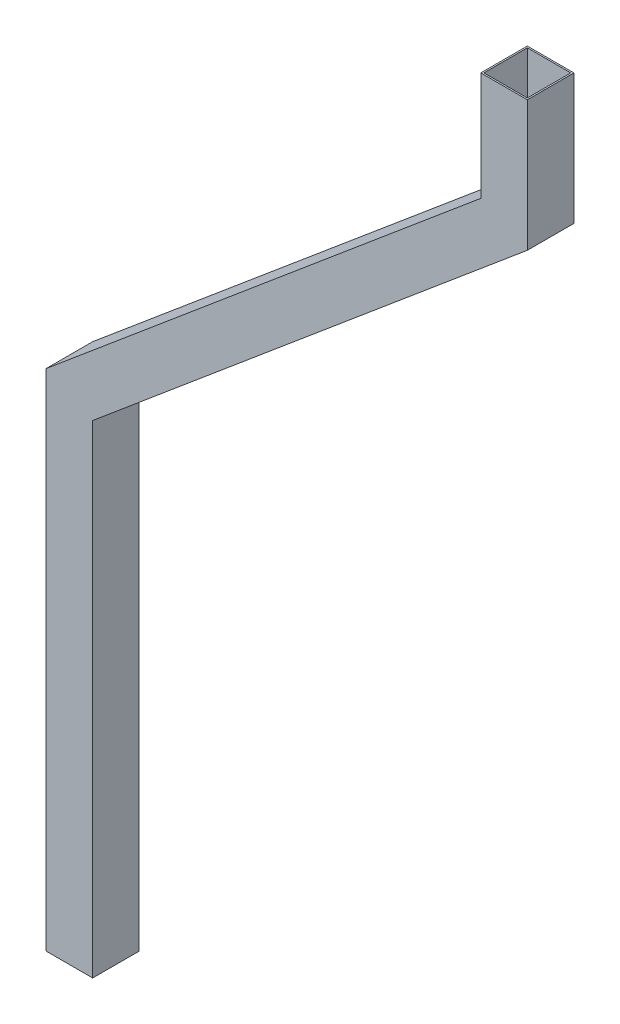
ISO-10303-21;
HEADER;
FILE_DESCRIPTION(('STEP AP214'),'2;1');
FILE_NAME('part.step','',(''),(''),'','','');
FILE_SCHEMA(('AUTOMOTIVE_DESIGN { 1 0 10303 214 1 1 1 1 }'));
ENDSEC;
DATA;
#1=APPLICATION_CONTEXT('core data for automotive mechanical design processes');
#2=APPLICATION_PROTOCOL_DEFINITION('international standard','automotive_design',2000,#1);
#3=PRODUCT_CONTEXT('',#1,'mechanical');
#4=PRODUCT('Part','Part','',(#3));
#5=PRODUCT_RELATED_PRODUCT_CATEGORY('part','',(#4));
#6=PRODUCT_DEFINITION_FORMATION('','',#4);
#7=PRODUCT_DEFINITION_CONTEXT('part definition',#1,'design');
#8=PRODUCT_DEFINITION('design','',#6,#7);
#9=PRODUCT_DEFINITION_SHAPE('','',#8);
#10=(LENGTH_UNIT() NAMED_UNIT(*) SI_UNIT(.MILLI.,.METRE.));
#11=(NAMED_UNIT(*) PLANE_ANGLE_UNIT() SI_UNIT($,.RADIAN.));
#12=(NAMED_UNIT(*) SI_UNIT($,.STERADIAN.) SOLID_ANGLE_UNIT());
#13=UNCERTAINTY_MEASURE_WITH_UNIT(LENGTH_MEASURE(1.E-05),#10,'distance_accuracy_value','');
#14=(GEOMETRIC_REPRESENTATION_CONTEXT(3) GLOBAL_UNCERTAINTY_ASSIGNED_CONTEXT((#13)) GLOBAL_UNIT_ASSIGNED_CONTEXT((#10,
#11,#12)) REPRESENTATION_CONTEXT('',''));
#15=CARTESIAN_POINT('',(0.,0.,0.));
#16=DIRECTION('',(0.,0.,1.));
#17=DIRECTION('',(1.,0.,0.));
#18=AXIS2_PLACEMENT_3D('',#15,#16,#17);
#19=CARTESIAN_POINT('',(280.,629.947896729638,0.));
#20=DIRECTION('',(0.,1.,0.));
#21=DIRECTION('',(0.,0.,1.));
#22=AXIS2_PLACEMENT_3D('',#19,#20,#21);
#23=PLANE('',#22);
#24=DIRECTION('',(0.,0.,1.));
#25=VECTOR('',#24,1.);
#26=CARTESIAN_POINT('',(281.,629.947896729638,0.));
#27=LINE('',#26,#25);
#28=CARTESIAN_POINT('',(281.,629.947896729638,1.));
#29=VERTEX_POINT('',#28);
#30=CARTESIAN_POINT('',(281.,629.947896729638,29.));
#31=VERTEX_POINT('',#30);
#32=EDGE_CURVE('E166',#29,#31,#27,.T.);
#33=ORIENTED_EDGE('',*,*,#32,.F.);
#34=DIRECTION('',(-1.,0.,0.));
#35=VECTOR('',#34,1.);
#36=CARTESIAN_POINT('',(280.,629.947896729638,1.));
#37=LINE('',#36,#35);
#38=CARTESIAN_POINT('',(309.,629.947896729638,1.));
#39=VERTEX_POINT('',#38);
#40=EDGE_CURVE('E199',#39,#29,#37,.T.);
#41=ORIENTED_EDGE('',*,*,#40,.F.);
#42=DIRECTION('',(0.,0.,-1.));
#43=VECTOR('',#42,1.);
#44=CARTESIAN_POINT('',(309.,629.947896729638,0.));
#45=LINE('',#44,#43);
#46=CARTESIAN_POINT('',(309.,629.947896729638,29.));
#47=VERTEX_POINT('',#46);
#48=EDGE_CURVE('E197',#47,#39,#45,.T.);
#49=ORIENTED_EDGE('',*,*,#48,.F.);
#50=DIRECTION('',(1.,0.,0.));
#51=VECTOR('',#50,1.);
#52=CARTESIAN_POINT('',(280.,629.947896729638,29.));
#53=LINE('',#52,#51);
#54=EDGE_CURVE('E195',#31,#47,#53,.T.);
#55=ORIENTED_EDGE('',*,*,#54,.F.);
#56=EDGE_LOOP('',(#33,#41,#49,#55));
#57=FACE_BOUND('',#56,.T.);
#58=DIRECTION('',(0.,0.,1.));
#59=VECTOR('',#58,1.);
#60=CARTESIAN_POINT('',(280.,629.947896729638,0.));
#61=LINE('',#60,#59);
#62=CARTESIAN_POINT('',(280.,629.947896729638,0.));
#63=VERTEX_POINT('',#62);
#64=CARTESIAN_POINT('',(280.,629.947896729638,30.));
#65=VERTEX_POINT('',#64);
#66=EDGE_CURVE('E261',#63,#65,#61,.T.);
#67=ORIENTED_EDGE('',*,*,#66,.T.);
#68=DIRECTION('',(1.,0.,0.));
#69=VECTOR('',#68,1.);
#70=CARTESIAN_POINT('',(280.,629.947896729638,30.));
#71=LINE('',#70,#69);
#72=CARTESIAN_POINT('',(310.,629.947896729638,30.));
#73=VERTEX_POINT('',#72);
#74=EDGE_CURVE('E259',#65,#73,#71,.T.);
#75=ORIENTED_EDGE('',*,*,#74,.T.);
#76=DIRECTION('',(0.,0.,-1.));
#77=VECTOR('',#76,1.);
#78=CARTESIAN_POINT('',(310.,629.947896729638,0.));
#79=LINE('',#78,#77);
#80=CARTESIAN_POINT('',(310.,629.947896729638,0.));
#81=VERTEX_POINT('',#80);
#82=EDGE_CURVE('E257',#73,#81,#79,.T.);
#83=ORIENTED_EDGE('',*,*,#82,.T.);
#84=DIRECTION('',(-1.,0.,0.));
#85=VECTOR('',#84,1.);
#86=CARTESIAN_POINT('',(280.,629.947896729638,0.));
#87=LINE('',#86,#85);
#88=EDGE_CURVE('E204',#81,#63,#87,.T.);
#89=ORIENTED_EDGE('',*,*,#88,.T.);
#90=EDGE_LOOP('',(#67,#75,#83,#89));
#91=FACE_BOUND('',#90,.T.);
#92=ADVANCED_FACE('F34',(#57,#91),#23,.T.);
#93=CARTESIAN_POINT('',(0.,0.,0.));
#94=DIRECTION('',(0.,1.,0.));
#95=DIRECTION('',(0.,0.,1.));
#96=AXIS2_PLACEMENT_3D('',#93,#94,#95);
#97=PLANE('',#96);
#98=DIRECTION('',(-1.,0.,0.));
#99=VECTOR('',#98,1.);
#100=CARTESIAN_POINT('',(0.,0.,1.));
#101=LINE('',#100,#99);
#102=CARTESIAN_POINT('',(29.,0.,1.));
#103=VERTEX_POINT('',#102);
#104=CARTESIAN_POINT('',(0.999999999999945,0.,1.));
#105=VERTEX_POINT('',#104);
#106=EDGE_CURVE('E189',#103,#105,#101,.T.);
#107=ORIENTED_EDGE('',*,*,#106,.T.);
#108=DIRECTION('',(0.,0.,1.));
#109=VECTOR('',#108,1.);
#110=CARTESIAN_POINT('',(1.,0.,0.));
#111=LINE('',#110,#109);
#112=CARTESIAN_POINT('',(1.,0.,29.));
#113=VERTEX_POINT('',#112);
#114=EDGE_CURVE('E201',#105,#113,#111,.T.);
#115=ORIENTED_EDGE('',*,*,#114,.T.);
#116=DIRECTION('',(1.,0.,0.));
#117=VECTOR('',#116,1.);
#118=CARTESIAN_POINT('',(0.,0.,29.));
#119=LINE('',#118,#117);
#120=CARTESIAN_POINT('',(29.,0.,29.));
#121=VERTEX_POINT('',#120);
#122=EDGE_CURVE('E205',#113,#121,#119,.T.);
#123=ORIENTED_EDGE('',*,*,#122,.T.);
#124=DIRECTION('',(0.,0.,-1.));
#125=VECTOR('',#124,1.);
#126=CARTESIAN_POINT('',(29.,0.,0.));
#127=LINE('',#126,#125);
#128=EDGE_CURVE('E208',#121,#103,#127,.T.);
#129=ORIENTED_EDGE('',*,*,#128,.T.);
#130=EDGE_LOOP('',(#107,#115,#123,#129));
#131=FACE_BOUND('',#130,.T.);
#132=DIRECTION('',(0.,0.,1.));
#133=VECTOR('',#132,1.);
#134=CARTESIAN_POINT('',(0.,0.,0.));
#135=LINE('',#134,#133);
#136=CARTESIAN_POINT('',(0.,0.,0.));
#137=VERTEX_POINT('',#136);
#138=CARTESIAN_POINT('',(0.,0.,30.));
#139=VERTEX_POINT('',#138);
#140=EDGE_CURVE('E11',#137,#139,#135,.T.);
#141=ORIENTED_EDGE('',*,*,#140,.F.);
#142=DIRECTION('',(-1.,0.,0.));
#143=VECTOR('',#142,1.);
#144=CARTESIAN_POINT('',(0.,0.,0.));
#145=LINE('',#144,#143);
#146=CARTESIAN_POINT('',(30.,0.,0.));
#147=VERTEX_POINT('',#146);
#148=EDGE_CURVE('E213',#147,#137,#145,.T.);
#149=ORIENTED_EDGE('',*,*,#148,.F.);
#150=DIRECTION('',(0.,0.,-1.));
#151=VECTOR('',#150,1.);
#152=CARTESIAN_POINT('',(30.,0.,0.));
#153=LINE('',#152,#151);
#154=CARTESIAN_POINT('',(30.,0.,30.));
#155=VERTEX_POINT('',#154);
#156=EDGE_CURVE('E216',#155,#147,#153,.T.);
#157=ORIENTED_EDGE('',*,*,#156,.F.);
#158=DIRECTION('',(1.,0.,0.));
#159=VECTOR('',#158,1.);
#160=CARTESIAN_POINT('',(0.,0.,30.));
#161=LINE('',#160,#159);
#162=EDGE_CURVE('E42',#139,#155,#161,.T.);
#163=ORIENTED_EDGE('',*,*,#162,.F.);
#164=EDGE_LOOP('',(#141,#149,#157,#163));
#165=FACE_BOUND('',#164,.T.);
#166=ADVANCED_FACE('F291',(#131,#165),#97,.F.);
#167=CARTESIAN_POINT('',(280.,544.459744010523,0.));
#168=DIRECTION('',(-1.,0.,0.));
#169=DIRECTION('',(0.,-1.,0.));
#170=AXIS2_PLACEMENT_3D('',#167,#168,#169);
#171=PLANE('',#170);
#172=DIRECTION('',(0.,0.,-1.));
#173=VECTOR('',#172,1.);
#174=CARTESIAN_POINT('',(280.,559.947896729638,0.));
#175=LINE('',#174,#173);
#176=CARTESIAN_POINT('',(280.,559.947896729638,30.));
#177=VERTEX_POINT('',#176);
#178=CARTESIAN_POINT('',(280.,559.947896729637,0.));
#179=VERTEX_POINT('',#178);
#180=EDGE_CURVE('E241',#177,#179,#175,.T.);
#181=ORIENTED_EDGE('',*,*,#180,.F.);
#182=DIRECTION('',(0.,1.,0.));
#183=VECTOR('',#182,1.);
#184=CARTESIAN_POINT('',(280.,544.459744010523,30.));
#185=LINE('',#184,#183);
#186=EDGE_CURVE('E268',#177,#65,#185,.T.);
#187=ORIENTED_EDGE('',*,*,#186,.T.);
#188=ORIENTED_EDGE('',*,*,#66,.F.);
#189=DIRECTION('',(0.,1.,0.));
#190=VECTOR('',#189,1.);
#191=CARTESIAN_POINT('',(280.,544.459744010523,0.));
#192=LINE('',#191,#190);
#193=EDGE_CURVE('E37',#179,#63,#192,.T.);
#194=ORIENTED_EDGE('',*,*,#193,.F.);
#195=EDGE_LOOP('',(#181,#187,#188,#194));
#196=FACE_BOUND('',#195,.T.);
#197=ADVANCED_FACE('F278',(#196),#171,.T.);
#198=CARTESIAN_POINT('',(310.,544.459744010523,0.));
#199=DIRECTION('',(1.,0.,0.));
#200=DIRECTION('',(0.,1.,0.));
#201=AXIS2_PLACEMENT_3D('',#198,#199,#200);
#202=PLANE('',#201);
#203=DIRECTION('',(0.,0.,1.));
#204=VECTOR('',#203,1.);
#205=CARTESIAN_POINT('',(310.,545.958666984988,-1.11022302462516E-13));
#206=LINE('',#205,#204);
#207=CARTESIAN_POINT('',(310.,545.958666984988,0.));
#208=VERTEX_POINT('',#207);
#209=CARTESIAN_POINT('',(310.,545.958666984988,30.));
#210=VERTEX_POINT('',#209);
#211=EDGE_CURVE('E234',#208,#210,#206,.T.);
#212=ORIENTED_EDGE('',*,*,#211,.F.);
#213=DIRECTION('',(0.,1.,0.));
#214=VECTOR('',#213,1.);
#215=CARTESIAN_POINT('',(310.,544.459744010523,0.));
#216=LINE('',#215,#214);
#217=EDGE_CURVE('E263',#208,#81,#216,.T.);
#218=ORIENTED_EDGE('',*,*,#217,.T.);
#219=ORIENTED_EDGE('',*,*,#82,.F.);
#220=DIRECTION('',(0.,1.,0.));
#221=VECTOR('',#220,1.);
#222=CARTESIAN_POINT('',(310.,544.459744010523,30.));
#223=LINE('',#222,#221);
#224=EDGE_CURVE('E266',#210,#73,#223,.T.);
#225=ORIENTED_EDGE('',*,*,#224,.F.);
#226=EDGE_LOOP('',(#212,#218,#219,#225));
#227=FACE_BOUND('',#226,.T.);
#228=ADVANCED_FACE('F300',(#227),#202,.T.);
#229=CARTESIAN_POINT('',(19.2836282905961,302.018666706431,0.));
#230=DIRECTION('',(0.642787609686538,-0.766044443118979,0.));
#231=DIRECTION('',(0.766044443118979,0.642787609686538,0.));
#232=AXIS2_PLACEMENT_3D('',#229,#230,#231);
#233=PLANE('',#232);
#234=DIRECTION('',(0.766044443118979,0.642787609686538,0.));
#235=VECTOR('',#234,1.);
#236=CARTESIAN_POINT('',(19.2836282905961,302.018666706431,0.));
#237=LINE('',#236,#235);
#238=CARTESIAN_POINT('',(30.,311.01077025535,0.));
#239=VERTEX_POINT('',#238);
#240=EDGE_CURVE('E249',#239,#208,#237,.T.);
#241=ORIENTED_EDGE('',*,*,#240,.T.);
#242=ORIENTED_EDGE('',*,*,#211,.T.);
#243=DIRECTION('',(0.766044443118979,0.642787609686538,0.));
#244=VECTOR('',#243,1.);
#245=CARTESIAN_POINT('',(19.2836282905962,302.018666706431,30.));
#246=LINE('',#245,#244);
#247=CARTESIAN_POINT('',(30.,311.01077025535,30.));
#248=VERTEX_POINT('',#247);
#249=EDGE_CURVE('E248',#248,#210,#246,.T.);
#250=ORIENTED_EDGE('',*,*,#249,.F.);
#251=DIRECTION('',(0.,0.,1.));
#252=VECTOR('',#251,1.);
#253=CARTESIAN_POINT('',(30.,311.01077025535,0.));
#254=LINE('',#253,#252);
#255=EDGE_CURVE('E230',#239,#248,#254,.T.);
#256=ORIENTED_EDGE('',*,*,#255,.F.);
#257=EDGE_LOOP('',(#241,#242,#250,#256));
#258=FACE_BOUND('',#257,.T.);
#259=ADVANCED_FACE('F298',(#258),#233,.T.);
#260=CARTESIAN_POINT('',(0.,325.,0.));
#261=DIRECTION('',(-0.642787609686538,0.766044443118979,0.));
#262=DIRECTION('',(-0.766044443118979,-0.642787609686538,0.));
#263=AXIS2_PLACEMENT_3D('',#260,#261,#262);
#264=PLANE('',#263);
#265=DIRECTION('',(0.766044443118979,0.642787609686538,0.));
#266=VECTOR('',#265,1.);
#267=CARTESIAN_POINT('',(0.,325.,30.));
#268=LINE('',#267,#266);
#269=CARTESIAN_POINT('',(0.,325.,30.));
#270=VERTEX_POINT('',#269);
#271=EDGE_CURVE('E245',#270,#177,#268,.T.);
#272=ORIENTED_EDGE('',*,*,#271,.T.);
#273=ORIENTED_EDGE('',*,*,#180,.T.);
#274=DIRECTION('',(0.766044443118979,0.642787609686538,0.));
#275=VECTOR('',#274,1.);
#276=CARTESIAN_POINT('',(0.,325.,0.));
#277=LINE('',#276,#275);
#278=CARTESIAN_POINT('',(0.,325.,0.));
#279=VERTEX_POINT('',#278);
#280=EDGE_CURVE('E242',#279,#179,#277,.T.);
#281=ORIENTED_EDGE('',*,*,#280,.F.);
#282=DIRECTION('',(0.,0.,1.));
#283=VECTOR('',#282,1.);
#284=CARTESIAN_POINT('',(0.,325.,0.));
#285=LINE('',#284,#283);
#286=EDGE_CURVE('E224',#279,#270,#285,.T.);
#287=ORIENTED_EDGE('',*,*,#286,.T.);
#288=EDGE_LOOP('',(#272,#273,#281,#287));
#289=FACE_BOUND('',#288,.T.);
#290=ADVANCED_FACE('F280',(#289),#264,.T.);
#291=CARTESIAN_POINT('',(0.,0.,0.));
#292=DIRECTION('',(-1.,0.,0.));
#293=DIRECTION('',(0.,0.,1.));
#294=AXIS2_PLACEMENT_3D('',#291,#292,#293);
#295=PLANE('',#294);
#296=DIRECTION('',(0.,1.,0.));
#297=VECTOR('',#296,1.);
#298=CARTESIAN_POINT('',(0.,0.,30.));
#299=LINE('',#298,#297);
#300=EDGE_CURVE('E225',#139,#270,#299,.T.);
#301=ORIENTED_EDGE('',*,*,#300,.T.);
#302=ORIENTED_EDGE('',*,*,#286,.F.);
#303=DIRECTION('',(0.,1.,0.));
#304=VECTOR('',#303,1.);
#305=CARTESIAN_POINT('',(0.,0.,0.));
#306=LINE('',#305,#304);
#307=EDGE_CURVE('E217',#137,#279,#306,.T.);
#308=ORIENTED_EDGE('',*,*,#307,.F.);
#309=ORIENTED_EDGE('',*,*,#140,.T.);
#310=EDGE_LOOP('',(#301,#302,#308,#309));
#311=FACE_BOUND('',#310,.T.);
#312=ADVANCED_FACE('F288',(#311),#295,.T.);
#313=CARTESIAN_POINT('',(0.,0.,30.));
#314=DIRECTION('',(0.,0.,1.));
#315=DIRECTION('',(1.,0.,0.));
#316=AXIS2_PLACEMENT_3D('',#313,#314,#315);
#317=PLANE('',#316);
#318=DIRECTION('',(0.,1.,0.));
#319=VECTOR('',#318,1.);
#320=CARTESIAN_POINT('',(30.,0.,30.));
#321=LINE('',#320,#319);
#322=EDGE_CURVE('E228',#155,#248,#321,.T.);
#323=ORIENTED_EDGE('',*,*,#322,.T.);
#324=ORIENTED_EDGE('',*,*,#249,.T.);
#325=ORIENTED_EDGE('',*,*,#224,.T.);
#326=ORIENTED_EDGE('',*,*,#74,.F.);
#327=ORIENTED_EDGE('',*,*,#186,.F.);
#328=ORIENTED_EDGE('',*,*,#271,.F.);
#329=ORIENTED_EDGE('',*,*,#300,.F.);
#330=ORIENTED_EDGE('',*,*,#162,.T.);
#331=EDGE_LOOP('',(#323,#324,#325,#326,#327,#328,#329,#330));
#332=FACE_BOUND('',#331,.T.);
#333=ADVANCED_FACE('F285',(#332),#317,.T.);
#334=CARTESIAN_POINT('',(30.,0.,0.));
#335=DIRECTION('',(1.,0.,0.));
#336=DIRECTION('',(0.,0.,-1.));
#337=AXIS2_PLACEMENT_3D('',#334,#335,#336);
#338=PLANE('',#337);
#339=DIRECTION('',(0.,1.,0.));
#340=VECTOR('',#339,1.);
#341=CARTESIAN_POINT('',(30.,0.,0.));
#342=LINE('',#341,#340);
#343=EDGE_CURVE('E233',#147,#239,#342,.T.);
#344=ORIENTED_EDGE('',*,*,#343,.T.);
#345=ORIENTED_EDGE('',*,*,#255,.T.);
#346=ORIENTED_EDGE('',*,*,#322,.F.);
#347=ORIENTED_EDGE('',*,*,#156,.T.);
#348=EDGE_LOOP('',(#344,#345,#346,#347));
#349=FACE_BOUND('',#348,.T.);
#350=ADVANCED_FACE('F295',(#349),#338,.T.);
#351=CARTESIAN_POINT('',(0.,0.,0.));
#352=DIRECTION('',(0.,0.,-1.));
#353=DIRECTION('',(-1.,0.,0.));
#354=AXIS2_PLACEMENT_3D('',#351,#352,#353);
#355=PLANE('',#354);
#356=ORIENTED_EDGE('',*,*,#307,.T.);
#357=ORIENTED_EDGE('',*,*,#280,.T.);
#358=ORIENTED_EDGE('',*,*,#193,.T.);
#359=ORIENTED_EDGE('',*,*,#88,.F.);
#360=ORIENTED_EDGE('',*,*,#217,.F.);
#361=ORIENTED_EDGE('',*,*,#240,.F.);
#362=ORIENTED_EDGE('',*,*,#343,.F.);
#363=ORIENTED_EDGE('',*,*,#148,.T.);
#364=EDGE_LOOP('',(#356,#357,#358,#359,#360,#361,#362,#363));
#365=FACE_BOUND('',#364,.T.);
#366=ADVANCED_FACE('F276',(#365),#355,.T.);
#367=CARTESIAN_POINT('',(281.,544.459744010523,0.));
#368=DIRECTION('',(-1.,0.,0.));
#369=DIRECTION('',(0.,-1.,0.));
#370=AXIS2_PLACEMENT_3D('',#367,#368,#369);
#371=PLANE('',#370);
#372=DIRECTION('',(0.,0.,-1.));
#373=VECTOR('',#372,1.);
#374=CARTESIAN_POINT('',(281.,559.481589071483,0.));
#375=LINE('',#374,#373);
#376=CARTESIAN_POINT('',(281.,559.481589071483,29.));
#377=VERTEX_POINT('',#376);
#378=CARTESIAN_POINT('',(281.,559.481589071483,1.));
#379=VERTEX_POINT('',#378);
#380=EDGE_CURVE('E150',#377,#379,#375,.T.);
#381=ORIENTED_EDGE('',*,*,#380,.T.);
#382=DIRECTION('',(0.,1.,0.));
#383=VECTOR('',#382,1.);
#384=CARTESIAN_POINT('',(281.,544.459744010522,1.));
#385=LINE('',#384,#383);
#386=EDGE_CURVE('E168',#379,#29,#385,.T.);
#387=ORIENTED_EDGE('',*,*,#386,.T.);
#388=ORIENTED_EDGE('',*,*,#32,.T.);
#389=DIRECTION('',(0.,1.,0.));
#390=VECTOR('',#389,1.);
#391=CARTESIAN_POINT('',(281.,544.459744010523,29.));
#392=LINE('',#391,#390);
#393=EDGE_CURVE('E163',#377,#31,#392,.T.);
#394=ORIENTED_EDGE('',*,*,#393,.F.);
#395=EDGE_LOOP('',(#381,#387,#388,#394));
#396=FACE_BOUND('',#395,.T.);
#397=ADVANCED_FACE('F164',(#396),#371,.F.);
#398=CARTESIAN_POINT('',(280.,544.459744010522,29.));
#399=DIRECTION('',(0.,0.,1.));
#400=DIRECTION('',(1.,0.,0.));
#401=AXIS2_PLACEMENT_3D('',#398,#399,#400);
#402=PLANE('',#401);
#403=DIRECTION('',(0.,1.,0.));
#404=VECTOR('',#403,1.);
#405=CARTESIAN_POINT('',(309.,544.459744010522,29.));
#406=LINE('',#405,#404);
#407=CARTESIAN_POINT('',(309.,546.424974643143,29.));
#408=VERTEX_POINT('',#407);
#409=EDGE_CURVE('E169',#408,#47,#406,.T.);
#410=ORIENTED_EDGE('',*,*,#409,.F.);
#411=DIRECTION('',(0.766044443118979,0.642787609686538,0.));
#412=VECTOR('',#411,1.);
#413=CARTESIAN_POINT('',(18.6408406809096,302.78471114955,29.));
#414=LINE('',#413,#412);
#415=CARTESIAN_POINT('',(29.,311.477077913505,29.));
#416=VERTEX_POINT('',#415);
#417=EDGE_CURVE('E174',#416,#408,#414,.T.);
#418=ORIENTED_EDGE('',*,*,#417,.F.);
#419=DIRECTION('',(0.,1.,0.));
#420=VECTOR('',#419,1.);
#421=CARTESIAN_POINT('',(29.,0.,29.));
#422=LINE('',#421,#420);
#423=EDGE_CURVE('E58',#121,#416,#422,.T.);
#424=ORIENTED_EDGE('',*,*,#423,.F.);
#425=ORIENTED_EDGE('',*,*,#122,.F.);
#426=DIRECTION('',(0.,1.,0.));
#427=VECTOR('',#426,1.);
#428=CARTESIAN_POINT('',(1.,0.,29.));
#429=LINE('',#428,#427);
#430=CARTESIAN_POINT('',(1.,324.533692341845,29.));
#431=VERTEX_POINT('',#430);
#432=EDGE_CURVE('E173',#113,#431,#429,.T.);
#433=ORIENTED_EDGE('',*,*,#432,.T.);
#434=DIRECTION('',(0.766044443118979,0.642787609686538,0.));
#435=VECTOR('',#434,1.);
#436=CARTESIAN_POINT('',(0.642787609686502,324.233955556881,29.));
#437=LINE('',#436,#435);
#438=EDGE_CURVE('E155',#431,#377,#437,.T.);
#439=ORIENTED_EDGE('',*,*,#438,.T.);
#440=ORIENTED_EDGE('',*,*,#393,.T.);
#441=ORIENTED_EDGE('',*,*,#54,.T.);
#442=EDGE_LOOP('',(#410,#418,#424,#425,#433,#439,#440,#441));
#443=FACE_BOUND('',#442,.T.);
#444=ADVANCED_FACE('F171',(#443),#402,.F.);
#445=CARTESIAN_POINT('',(309.,544.459744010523,0.));
#446=DIRECTION('',(1.,0.,0.));
#447=DIRECTION('',(0.,1.,0.));
#448=AXIS2_PLACEMENT_3D('',#445,#446,#447);
#449=PLANE('',#448);
#450=DIRECTION('',(0.,0.,1.));
#451=VECTOR('',#450,1.);
#452=CARTESIAN_POINT('',(309.,546.424974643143,0.));
#453=LINE('',#452,#451);
#454=CARTESIAN_POINT('',(309.,546.424974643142,1.));
#455=VERTEX_POINT('',#454);
#456=EDGE_CURVE('E160',#455,#408,#453,.T.);
#457=ORIENTED_EDGE('',*,*,#456,.T.);
#458=ORIENTED_EDGE('',*,*,#409,.T.);
#459=ORIENTED_EDGE('',*,*,#48,.T.);
#460=DIRECTION('',(0.,1.,0.));
#461=VECTOR('',#460,1.);
#462=CARTESIAN_POINT('',(309.,544.459744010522,1.));
#463=LINE('',#462,#461);
#464=EDGE_CURVE('E50',#455,#39,#463,.T.);
#465=ORIENTED_EDGE('',*,*,#464,.F.);
#466=EDGE_LOOP('',(#457,#458,#459,#465));
#467=FACE_BOUND('',#466,.T.);
#468=ADVANCED_FACE('F379',(#467),#449,.F.);
#469=CARTESIAN_POINT('',(280.,544.459744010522,1.));
#470=DIRECTION('',(0.,0.,-1.));
#471=DIRECTION('',(-1.,0.,0.));
#472=AXIS2_PLACEMENT_3D('',#469,#470,#471);
#473=PLANE('',#472);
#474=ORIENTED_EDGE('',*,*,#386,.F.);
#475=DIRECTION('',(0.766044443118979,0.642787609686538,0.));
#476=VECTOR('',#475,1.);
#477=CARTESIAN_POINT('',(0.642787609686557,324.233955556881,1.));
#478=LINE('',#477,#476);
#479=CARTESIAN_POINT('',(1.,324.533692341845,1.00000000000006));
#480=VERTEX_POINT('',#479);
#481=EDGE_CURVE('E157',#480,#379,#478,.T.);
#482=ORIENTED_EDGE('',*,*,#481,.F.);
#483=DIRECTION('',(0.,1.,0.));
#484=VECTOR('',#483,1.);
#485=CARTESIAN_POINT('',(0.999999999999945,0.,1.));
#486=LINE('',#485,#484);
#487=EDGE_CURVE('E185',#105,#480,#486,.T.);
#488=ORIENTED_EDGE('',*,*,#487,.F.);
#489=ORIENTED_EDGE('',*,*,#106,.F.);
#490=DIRECTION('',(0.,1.,0.));
#491=VECTOR('',#490,1.);
#492=CARTESIAN_POINT('',(29.,0.,1.));
#493=LINE('',#492,#491);
#494=CARTESIAN_POINT('',(29.,311.477077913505,1.));
#495=VERTEX_POINT('',#494);
#496=EDGE_CURVE('E191',#103,#495,#493,.T.);
#497=ORIENTED_EDGE('',*,*,#496,.T.);
#498=DIRECTION('',(0.766044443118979,0.642787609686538,0.));
#499=VECTOR('',#498,1.);
#500=CARTESIAN_POINT('',(18.6408406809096,302.78471114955,0.999999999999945));
#501=LINE('',#500,#499);
#502=EDGE_CURVE('E178',#495,#455,#501,.T.);
#503=ORIENTED_EDGE('',*,*,#502,.T.);
#504=ORIENTED_EDGE('',*,*,#464,.T.);
#505=ORIENTED_EDGE('',*,*,#40,.T.);
#506=EDGE_LOOP('',(#474,#482,#488,#489,#497,#503,#504,#505));
#507=FACE_BOUND('',#506,.T.);
#508=ADVANCED_FACE('F392',(#507),#473,.F.);
#509=CARTESIAN_POINT('',(18.6408406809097,302.78471114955,0.));
#510=DIRECTION('',(0.642787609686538,-0.766044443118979,0.));
#511=DIRECTION('',(0.766044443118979,0.642787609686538,0.));
#512=AXIS2_PLACEMENT_3D('',#509,#510,#511);
#513=PLANE('',#512);
#514=ORIENTED_EDGE('',*,*,#502,.F.);
#515=DIRECTION('',(0.,0.,1.));
#516=VECTOR('',#515,1.);
#517=CARTESIAN_POINT('',(29.,311.477077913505,0.));
#518=LINE('',#517,#516);
#519=EDGE_CURVE('E182',#495,#416,#518,.T.);
#520=ORIENTED_EDGE('',*,*,#519,.T.);
#521=ORIENTED_EDGE('',*,*,#417,.T.);
#522=ORIENTED_EDGE('',*,*,#456,.F.);
#523=EDGE_LOOP('',(#514,#520,#521,#522));
#524=FACE_BOUND('',#523,.T.);
#525=ADVANCED_FACE('F400',(#524),#513,.F.);
#526=CARTESIAN_POINT('',(0.642787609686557,324.233955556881,0.));
#527=DIRECTION('',(-0.642787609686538,0.766044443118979,0.));
#528=DIRECTION('',(-0.766044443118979,-0.642787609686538,0.));
#529=AXIS2_PLACEMENT_3D('',#526,#527,#528);
#530=PLANE('',#529);
#531=ORIENTED_EDGE('',*,*,#438,.F.);
#532=DIRECTION('',(0.,0.,1.));
#533=VECTOR('',#532,1.);
#534=CARTESIAN_POINT('',(1.,324.533692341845,0.));
#535=LINE('',#534,#533);
#536=EDGE_CURVE('E183',#480,#431,#535,.T.);
#537=ORIENTED_EDGE('',*,*,#536,.F.);
#538=ORIENTED_EDGE('',*,*,#481,.T.);
#539=ORIENTED_EDGE('',*,*,#380,.F.);
#540=EDGE_LOOP('',(#531,#537,#538,#539));
#541=FACE_BOUND('',#540,.T.);
#542=ADVANCED_FACE('F152',(#541),#530,.F.);
#543=CARTESIAN_POINT('',(1.,0.,0.));
#544=DIRECTION('',(-1.,0.,0.));
#545=DIRECTION('',(0.,0.,1.));
#546=AXIS2_PLACEMENT_3D('',#543,#544,#545);
#547=PLANE('',#546);
#548=ORIENTED_EDGE('',*,*,#432,.F.);
#549=ORIENTED_EDGE('',*,*,#114,.F.);
#550=ORIENTED_EDGE('',*,*,#487,.T.);
#551=ORIENTED_EDGE('',*,*,#536,.T.);
#552=EDGE_LOOP('',(#548,#549,#550,#551));
#553=FACE_BOUND('',#552,.T.);
#554=ADVANCED_FACE('F311',(#553),#547,.F.);
#555=CARTESIAN_POINT('',(29.,0.,0.));
#556=DIRECTION('',(1.,0.,0.));
#557=DIRECTION('',(0.,0.,-1.));
#558=AXIS2_PLACEMENT_3D('',#555,#556,#557);
#559=PLANE('',#558);
#560=ORIENTED_EDGE('',*,*,#496,.F.);
#561=ORIENTED_EDGE('',*,*,#128,.F.);
#562=ORIENTED_EDGE('',*,*,#423,.T.);
#563=ORIENTED_EDGE('',*,*,#519,.F.);
#564=EDGE_LOOP('',(#560,#561,#562,#563));
#565=FACE_BOUND('',#564,.T.);
#566=ADVANCED_FACE('F305',(#565),#559,.F.);
#567=CLOSED_SHELL('',(#92,#166,#197,#228,#259,#290,#312,#333,#350,#366,#397,#444,#468,#508,#525,
#542,#554,#566));
#568=MANIFOLD_SOLID_BREP('B2',#567);
#569=ADVANCED_BREP_SHAPE_REPRESENTATION('',(#18,#568),#14);
#570=SHAPE_DEFINITION_REPRESENTATION(#9,#569);
ENDSEC;
END-ISO-10303-21;
